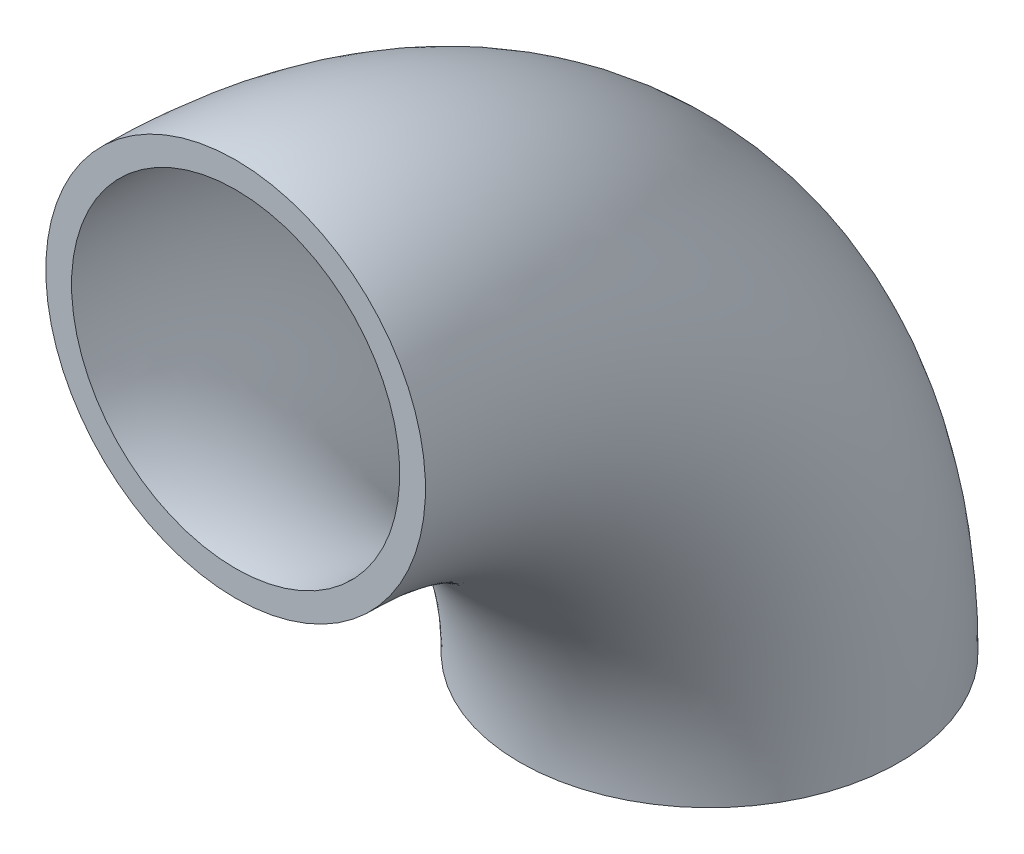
from build123d import *

# Parameters (mm, degrees)
ESQUISSE1_R   = 38.05
ESQUISSE1_R_2 = 32.89


with BuildPart() as part:
    # Balayage2: sweep along a path in Esquisse2
    with BuildLine(Plane(origin=(0, 0, 0), x_dir=(0, 0, -1), z_dir=(1, 0, 0))) as balayage2_path:
        ThreePointArc((95, -95), (67.175144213, -27.824855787), (0, 0))
    # Esquisse1 → Balayage2 (sweep)
    with BuildSketch(Plane.XY):
        Circle(ESQUISSE1_R)
        Circle(ESQUISSE1_R_2, mode=Mode.SUBTRACT)
    sweep(path=balayage2_path.line)


solid = part.part
